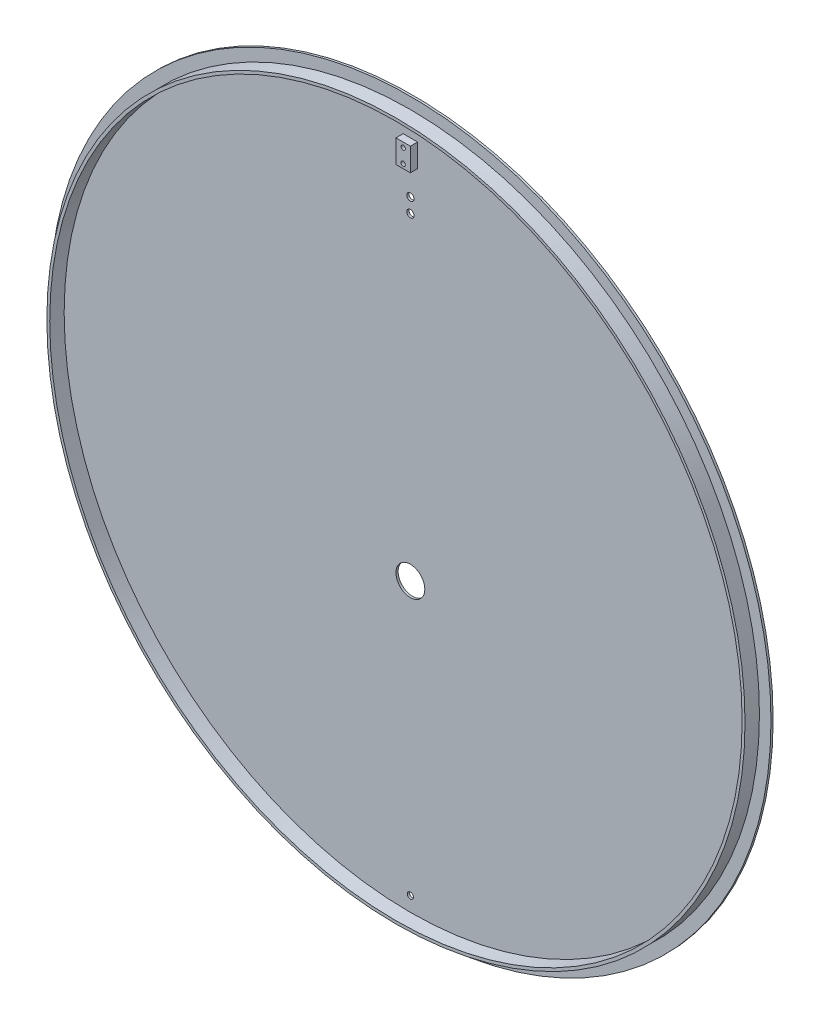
ISO-10303-21;
HEADER;
FILE_DESCRIPTION(('STEP AP214'),'2;1');
FILE_NAME('part.step','',(''),(''),'','','');
FILE_SCHEMA(('AUTOMOTIVE_DESIGN { 1 0 10303 214 1 1 1 1 }'));
ENDSEC;
DATA;
#1=APPLICATION_CONTEXT('core data for automotive mechanical design processes');
#2=APPLICATION_PROTOCOL_DEFINITION('international standard','automotive_design',2000,#1);
#3=PRODUCT_CONTEXT('',#1,'mechanical');
#4=PRODUCT('Part','Part','',(#3));
#5=PRODUCT_RELATED_PRODUCT_CATEGORY('part','',(#4));
#6=PRODUCT_DEFINITION_FORMATION('','',#4);
#7=PRODUCT_DEFINITION_CONTEXT('part definition',#1,'design');
#8=PRODUCT_DEFINITION('design','',#6,#7);
#9=PRODUCT_DEFINITION_SHAPE('','',#8);
#10=(LENGTH_UNIT() NAMED_UNIT(*) SI_UNIT(.MILLI.,.METRE.));
#11=(NAMED_UNIT(*) PLANE_ANGLE_UNIT() SI_UNIT($,.RADIAN.));
#12=(NAMED_UNIT(*) SI_UNIT($,.STERADIAN.) SOLID_ANGLE_UNIT());
#13=UNCERTAINTY_MEASURE_WITH_UNIT(LENGTH_MEASURE(1.E-05),#10,'distance_accuracy_value','');
#14=(GEOMETRIC_REPRESENTATION_CONTEXT(3) GLOBAL_UNCERTAINTY_ASSIGNED_CONTEXT((#13)) GLOBAL_UNIT_ASSIGNED_CONTEXT((#10,
#11,#12)) REPRESENTATION_CONTEXT('',''));
#15=CARTESIAN_POINT('',(0.,0.,0.));
#16=DIRECTION('',(0.,0.,1.));
#17=DIRECTION('',(1.,0.,0.));
#18=AXIS2_PLACEMENT_3D('',#15,#16,#17);
#19=CARTESIAN_POINT('',(0.,0.,3.));
#20=DIRECTION('',(0.,0.,1.));
#21=DIRECTION('',(1.,0.,0.));
#22=AXIS2_PLACEMENT_3D('',#19,#20,#21);
#23=PLANE('',#22);
#24=CARTESIAN_POINT('',(0.,0.,3.));
#25=DIRECTION('',(0.,0.,1.));
#26=DIRECTION('',(1.,0.,0.));
#27=AXIS2_PLACEMENT_3D('',#24,#25,#26);
#28=CIRCLE('',#27,500.);
#29=CARTESIAN_POINT('',(500.,0.,3.));
#30=VERTEX_POINT('',#29);
#31=EDGE_CURVE('E148',#30,#30,#28,.T.);
#32=ORIENTED_EDGE('',*,*,#31,.T.);
#33=EDGE_LOOP('',(#32));
#34=FACE_BOUND('',#33,.T.);
#35=CARTESIAN_POINT('',(0.,0.,3.));
#36=DIRECTION('',(0.,0.,1.));
#37=DIRECTION('',(1.,0.,0.));
#38=AXIS2_PLACEMENT_3D('',#35,#36,#37);
#39=CIRCLE('',#38,484.);
#40=CARTESIAN_POINT('',(484.,0.,3.));
#41=VERTEX_POINT('',#40);
#42=EDGE_CURVE('E139',#41,#41,#39,.T.);
#43=ORIENTED_EDGE('',*,*,#42,.F.);
#44=EDGE_LOOP('',(#43));
#45=FACE_BOUND('',#44,.T.);
#46=ADVANCED_FACE('F31',(#34,#45),#23,.T.);
#47=CARTESIAN_POINT('',(0.,0.,3.));
#48=DIRECTION('',(0.,0.,-1.));
#49=DIRECTION('',(-1.,0.,0.));
#50=AXIS2_PLACEMENT_3D('',#47,#48,#49);
#51=CYLINDRICAL_SURFACE('',#50,500.);
#52=ORIENTED_EDGE('',*,*,#31,.F.);
#53=EDGE_LOOP('',(#52));
#54=FACE_BOUND('',#53,.T.);
#55=CARTESIAN_POINT('',(0.,0.,0.));
#56=DIRECTION('',(0.,0.,1.));
#57=DIRECTION('',(1.,0.,0.));
#58=AXIS2_PLACEMENT_3D('',#55,#56,#57);
#59=CIRCLE('',#58,500.);
#60=CARTESIAN_POINT('',(500.,0.,0.));
#61=VERTEX_POINT('',#60);
#62=EDGE_CURVE('E145',#61,#61,#59,.T.);
#63=ORIENTED_EDGE('',*,*,#62,.T.);
#64=EDGE_LOOP('',(#63));
#65=FACE_BOUND('',#64,.T.);
#66=ADVANCED_FACE('F33',(#54,#65),#51,.T.);
#67=CARTESIAN_POINT('',(0.,0.,0.));
#68=DIRECTION('',(0.,0.,1.));
#69=DIRECTION('',(1.,0.,0.));
#70=AXIS2_PLACEMENT_3D('',#67,#68,#69);
#71=PLANE('',#70);
#72=CARTESIAN_POINT('',(0.,379.,0.));
#73=DIRECTION('',(0.,0.,1.));
#74=DIRECTION('',(1.,0.,0.));
#75=AXIS2_PLACEMENT_3D('',#72,#73,#74);
#76=CIRCLE('',#75,5.);
#77=CARTESIAN_POINT('',(5.,379.,0.));
#78=VERTEX_POINT('',#77);
#79=EDGE_CURVE('E112',#78,#78,#76,.T.);
#80=ORIENTED_EDGE('',*,*,#79,.T.);
#81=EDGE_LOOP('',(#80));
#82=FACE_BOUND('',#81,.T.);
#83=CARTESIAN_POINT('',(0.,359.,0.));
#84=DIRECTION('',(0.,0.,1.));
#85=DIRECTION('',(1.,0.,0.));
#86=AXIS2_PLACEMENT_3D('',#83,#84,#85);
#87=CIRCLE('',#86,5.);
#88=CARTESIAN_POINT('',(5.,359.,0.));
#89=VERTEX_POINT('',#88);
#90=EDGE_CURVE('E118',#89,#89,#87,.T.);
#91=ORIENTED_EDGE('',*,*,#90,.T.);
#92=EDGE_LOOP('',(#91));
#93=FACE_BOUND('',#92,.T.);
#94=CARTESIAN_POINT('',(0.,-459.81,0.));
#95=DIRECTION('',(0.,0.,1.));
#96=DIRECTION('',(1.,0.,0.));
#97=AXIS2_PLACEMENT_3D('',#94,#95,#96);
#98=CIRCLE('',#97,4.25);
#99=CARTESIAN_POINT('',(4.25,-459.81,0.));
#100=VERTEX_POINT('',#99);
#101=EDGE_CURVE('E126',#100,#100,#98,.T.);
#102=ORIENTED_EDGE('',*,*,#101,.T.);
#103=EDGE_LOOP('',(#102));
#104=FACE_BOUND('',#103,.T.);
#105=CARTESIAN_POINT('',(0.,-82.,0.));
#106=DIRECTION('',(0.,0.,1.));
#107=DIRECTION('',(1.,0.,0.));
#108=AXIS2_PLACEMENT_3D('',#105,#106,#107);
#109=CIRCLE('',#108,20.);
#110=CARTESIAN_POINT('',(20.,-82.,0.));
#111=VERTEX_POINT('',#110);
#112=EDGE_CURVE('E130',#111,#111,#109,.T.);
#113=ORIENTED_EDGE('',*,*,#112,.T.);
#114=EDGE_LOOP('',(#113));
#115=FACE_BOUND('',#114,.T.);
#116=ORIENTED_EDGE('',*,*,#62,.F.);
#117=EDGE_LOOP('',(#116));
#118=FACE_BOUND('',#117,.T.);
#119=ADVANCED_FACE('F176',(#82,#93,#104,#115,#118),#71,.F.);
#120=CARTESIAN_POINT('',(0.,0.,23.));
#121=DIRECTION('',(0.,0.,1.));
#122=DIRECTION('',(1.,0.,0.));
#123=AXIS2_PLACEMENT_3D('',#120,#121,#122);
#124=PLANE('',#123);
#125=CARTESIAN_POINT('',(0.,0.,23.));
#126=DIRECTION('',(0.,0.,1.));
#127=DIRECTION('',(1.,0.,0.));
#128=AXIS2_PLACEMENT_3D('',#125,#126,#127);
#129=CIRCLE('',#128,480.);
#130=CARTESIAN_POINT('',(480.,0.,23.));
#131=VERTEX_POINT('',#130);
#132=EDGE_CURVE('E133',#131,#131,#129,.T.);
#133=ORIENTED_EDGE('',*,*,#132,.F.);
#134=EDGE_LOOP('',(#133));
#135=FACE_BOUND('',#134,.T.);
#136=CARTESIAN_POINT('',(0.,0.,23.));
#137=DIRECTION('',(0.,0.,1.));
#138=DIRECTION('',(1.,0.,0.));
#139=AXIS2_PLACEMENT_3D('',#136,#137,#138);
#140=CIRCLE('',#139,484.);
#141=CARTESIAN_POINT('',(484.,0.,23.));
#142=VERTEX_POINT('',#141);
#143=EDGE_CURVE('E142',#142,#142,#140,.T.);
#144=ORIENTED_EDGE('',*,*,#143,.T.);
#145=EDGE_LOOP('',(#144));
#146=FACE_BOUND('',#145,.T.);
#147=ADVANCED_FACE('F205',(#135,#146),#124,.T.);
#148=CARTESIAN_POINT('',(0.,0.,23.));
#149=DIRECTION('',(0.,0.,-1.));
#150=DIRECTION('',(-1.,0.,0.));
#151=AXIS2_PLACEMENT_3D('',#148,#149,#150);
#152=CYLINDRICAL_SURFACE('',#151,484.);
#153=ORIENTED_EDGE('',*,*,#143,.F.);
#154=EDGE_LOOP('',(#153));
#155=FACE_BOUND('',#154,.T.);
#156=ORIENTED_EDGE('',*,*,#42,.T.);
#157=EDGE_LOOP('',(#156));
#158=FACE_BOUND('',#157,.T.);
#159=ADVANCED_FACE('F189',(#155,#158),#152,.T.);
#160=CARTESIAN_POINT('',(0.,0.,3.));
#161=DIRECTION('',(0.,0.,1.));
#162=DIRECTION('',(1.,0.,0.));
#163=AXIS2_PLACEMENT_3D('',#160,#161,#162);
#164=CYLINDRICAL_SURFACE('',#163,480.);
#165=CARTESIAN_POINT('',(0.,0.,3.));
#166=DIRECTION('',(0.,0.,1.));
#167=DIRECTION('',(1.,0.,0.));
#168=AXIS2_PLACEMENT_3D('',#165,#166,#167);
#169=CIRCLE('',#168,480.);
#170=CARTESIAN_POINT('',(480.,0.,3.));
#171=VERTEX_POINT('',#170);
#172=EDGE_CURVE('E136',#171,#171,#169,.T.);
#173=ORIENTED_EDGE('',*,*,#172,.F.);
#174=EDGE_LOOP('',(#173));
#175=FACE_BOUND('',#174,.T.);
#176=ORIENTED_EDGE('',*,*,#132,.T.);
#177=EDGE_LOOP('',(#176));
#178=FACE_BOUND('',#177,.T.);
#179=ADVANCED_FACE('F181',(#175,#178),#164,.F.);
#180=DIRECTION('',(0.,-1.,0.));
#181=VECTOR('',#180,1.);
#182=CARTESIAN_POINT('',(10.,-1056.14142135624,3.));
#183=LINE('',#182,#181);
#184=CARTESIAN_POINT('',(10.,450.,3.));
#185=VERTEX_POINT('',#184);
#186=CARTESIAN_POINT('',(10.,418.,3.));
#187=VERTEX_POINT('',#186);
#188=EDGE_CURVE('E77',#185,#187,#183,.T.);
#189=ORIENTED_EDGE('',*,*,#188,.T.);
#190=DIRECTION('',(-1.,0.,0.));
#191=VECTOR('',#190,1.);
#192=CARTESIAN_POINT('',(0.,418.,3.));
#193=LINE('',#192,#191);
#194=CARTESIAN_POINT('',(-10.,418.,3.));
#195=VERTEX_POINT('',#194);
#196=EDGE_CURVE('E104',#187,#195,#193,.T.);
#197=ORIENTED_EDGE('',*,*,#196,.T.);
#198=DIRECTION('',(0.,1.,0.));
#199=VECTOR('',#198,1.);
#200=CARTESIAN_POINT('',(-10.,-1056.14142135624,3.));
#201=LINE('',#200,#199);
#202=CARTESIAN_POINT('',(-10.,450.,3.));
#203=VERTEX_POINT('',#202);
#204=EDGE_CURVE('E51',#195,#203,#201,.T.);
#205=ORIENTED_EDGE('',*,*,#204,.T.);
#206=DIRECTION('',(1.,0.,0.));
#207=VECTOR('',#206,1.);
#208=CARTESIAN_POINT('',(0.,450.,3.));
#209=LINE('',#208,#207);
#210=EDGE_CURVE('E46',#203,#185,#209,.T.);
#211=ORIENTED_EDGE('',*,*,#210,.T.);
#212=EDGE_LOOP('',(#189,#197,#205,#211));
#213=FACE_BOUND('',#212,.T.);
#214=CARTESIAN_POINT('',(0.,379.,3.));
#215=DIRECTION('',(0.,0.,1.));
#216=DIRECTION('',(1.,0.,0.));
#217=AXIS2_PLACEMENT_3D('',#214,#215,#216);
#218=CIRCLE('',#217,5.);
#219=CARTESIAN_POINT('',(5.,379.,3.));
#220=VERTEX_POINT('',#219);
#221=EDGE_CURVE('E80',#220,#220,#218,.T.);
#222=ORIENTED_EDGE('',*,*,#221,.F.);
#223=EDGE_LOOP('',(#222));
#224=FACE_BOUND('',#223,.T.);
#225=CARTESIAN_POINT('',(0.,359.,3.));
#226=DIRECTION('',(0.,0.,1.));
#227=DIRECTION('',(1.,0.,0.));
#228=AXIS2_PLACEMENT_3D('',#225,#226,#227);
#229=CIRCLE('',#228,5.);
#230=CARTESIAN_POINT('',(5.,359.,3.));
#231=VERTEX_POINT('',#230);
#232=EDGE_CURVE('E115',#231,#231,#229,.T.);
#233=ORIENTED_EDGE('',*,*,#232,.F.);
#234=EDGE_LOOP('',(#233));
#235=FACE_BOUND('',#234,.T.);
#236=CARTESIAN_POINT('',(0.,-459.81,3.));
#237=DIRECTION('',(0.,0.,1.));
#238=DIRECTION('',(1.,0.,0.));
#239=AXIS2_PLACEMENT_3D('',#236,#237,#238);
#240=CIRCLE('',#239,4.25);
#241=CARTESIAN_POINT('',(4.25,-459.81,3.));
#242=VERTEX_POINT('',#241);
#243=EDGE_CURVE('E121',#242,#242,#240,.T.);
#244=ORIENTED_EDGE('',*,*,#243,.F.);
#245=EDGE_LOOP('',(#244));
#246=FACE_BOUND('',#245,.T.);
#247=CARTESIAN_POINT('',(0.,-82.,3.));
#248=DIRECTION('',(0.,0.,1.));
#249=DIRECTION('',(1.,0.,0.));
#250=AXIS2_PLACEMENT_3D('',#247,#248,#249);
#251=CIRCLE('',#250,20.);
#252=CARTESIAN_POINT('',(20.,-82.,3.));
#253=VERTEX_POINT('',#252);
#254=EDGE_CURVE('E129',#253,#253,#251,.T.);
#255=ORIENTED_EDGE('',*,*,#254,.F.);
#256=EDGE_LOOP('',(#255));
#257=FACE_BOUND('',#256,.T.);
#258=ORIENTED_EDGE('',*,*,#172,.T.);
#259=EDGE_LOOP('',(#258));
#260=FACE_BOUND('',#259,.T.);
#261=ADVANCED_FACE('F166',(#213,#224,#235,#246,#257,#260),#23,.T.);
#262=CARTESIAN_POINT('',(0.,-82.,0.));
#263=DIRECTION('',(0.,0.,1.));
#264=DIRECTION('',(1.,0.,0.));
#265=AXIS2_PLACEMENT_3D('',#262,#263,#264);
#266=CYLINDRICAL_SURFACE('',#265,20.);
#267=ORIENTED_EDGE('',*,*,#112,.F.);
#268=EDGE_LOOP('',(#267));
#269=FACE_BOUND('',#268,.T.);
#270=ORIENTED_EDGE('',*,*,#254,.T.);
#271=EDGE_LOOP('',(#270));
#272=FACE_BOUND('',#271,.T.);
#273=ADVANCED_FACE('F180',(#269,#272),#266,.F.);
#274=CARTESIAN_POINT('',(0.,-459.81,3.));
#275=DIRECTION('',(0.,0.,1.));
#276=DIRECTION('',(1.,0.,0.));
#277=AXIS2_PLACEMENT_3D('',#274,#275,#276);
#278=CYLINDRICAL_SURFACE('',#277,4.25);
#279=ORIENTED_EDGE('',*,*,#243,.T.);
#280=EDGE_LOOP('',(#279));
#281=FACE_BOUND('',#280,.T.);
#282=ORIENTED_EDGE('',*,*,#101,.F.);
#283=EDGE_LOOP('',(#282));
#284=FACE_BOUND('',#283,.T.);
#285=ADVANCED_FACE('F186',(#281,#284),#278,.F.);
#286=CARTESIAN_POINT('',(0.,359.,0.));
#287=DIRECTION('',(0.,0.,1.));
#288=DIRECTION('',(1.,0.,0.));
#289=AXIS2_PLACEMENT_3D('',#286,#287,#288);
#290=CYLINDRICAL_SURFACE('',#289,5.);
#291=ORIENTED_EDGE('',*,*,#90,.F.);
#292=EDGE_LOOP('',(#291));
#293=FACE_BOUND('',#292,.T.);
#294=ORIENTED_EDGE('',*,*,#232,.T.);
#295=EDGE_LOOP('',(#294));
#296=FACE_BOUND('',#295,.T.);
#297=ADVANCED_FACE('F219',(#293,#296),#290,.F.);
#298=CARTESIAN_POINT('',(0.,379.,0.));
#299=DIRECTION('',(0.,0.,1.));
#300=DIRECTION('',(1.,0.,0.));
#301=AXIS2_PLACEMENT_3D('',#298,#299,#300);
#302=CYLINDRICAL_SURFACE('',#301,5.);
#303=ORIENTED_EDGE('',*,*,#79,.F.);
#304=EDGE_LOOP('',(#303));
#305=FACE_BOUND('',#304,.T.);
#306=ORIENTED_EDGE('',*,*,#221,.T.);
#307=EDGE_LOOP('',(#306));
#308=FACE_BOUND('',#307,.T.);
#309=ADVANCED_FACE('F223',(#305,#308),#302,.F.);
#310=CARTESIAN_POINT('',(10.,-1056.14142135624,13.));
#311=DIRECTION('',(1.,0.,0.));
#312=DIRECTION('',(0.,0.,-1.));
#313=AXIS2_PLACEMENT_3D('',#310,#311,#312);
#314=PLANE('',#313);
#315=ORIENTED_EDGE('',*,*,#188,.F.);
#316=DIRECTION('',(0.,0.,-1.));
#317=VECTOR('',#316,1.);
#318=CARTESIAN_POINT('',(10.,450.,13.));
#319=LINE('',#318,#317);
#320=CARTESIAN_POINT('',(10.,450.,13.));
#321=VERTEX_POINT('',#320);
#322=EDGE_CURVE('E71',#321,#185,#319,.T.);
#323=ORIENTED_EDGE('',*,*,#322,.F.);
#324=DIRECTION('',(0.,-1.,0.));
#325=VECTOR('',#324,1.);
#326=CARTESIAN_POINT('',(10.,-1056.14142135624,13.));
#327=LINE('',#326,#325);
#328=CARTESIAN_POINT('',(10.,418.,13.));
#329=VERTEX_POINT('',#328);
#330=EDGE_CURVE('E75',#321,#329,#327,.T.);
#331=ORIENTED_EDGE('',*,*,#330,.T.);
#332=DIRECTION('',(0.,0.,-1.));
#333=VECTOR('',#332,1.);
#334=CARTESIAN_POINT('',(10.,418.,13.));
#335=LINE('',#334,#333);
#336=EDGE_CURVE('E100',#329,#187,#335,.T.);
#337=ORIENTED_EDGE('',*,*,#336,.T.);
#338=EDGE_LOOP('',(#315,#323,#331,#337));
#339=FACE_BOUND('',#338,.T.);
#340=ADVANCED_FACE('F73',(#339),#314,.T.);
#341=CARTESIAN_POINT('',(0.,450.,13.));
#342=DIRECTION('',(0.,1.,0.));
#343=DIRECTION('',(0.,0.,1.));
#344=AXIS2_PLACEMENT_3D('',#341,#342,#343);
#345=PLANE('',#344);
#346=ORIENTED_EDGE('',*,*,#210,.F.);
#347=DIRECTION('',(0.,0.,-1.));
#348=VECTOR('',#347,1.);
#349=CARTESIAN_POINT('',(-10.,450.,13.));
#350=LINE('',#349,#348);
#351=CARTESIAN_POINT('',(-10.,450.,13.));
#352=VERTEX_POINT('',#351);
#353=EDGE_CURVE('E81',#352,#203,#350,.T.);
#354=ORIENTED_EDGE('',*,*,#353,.F.);
#355=DIRECTION('',(1.,0.,0.));
#356=VECTOR('',#355,1.);
#357=CARTESIAN_POINT('',(0.,450.,13.));
#358=LINE('',#357,#356);
#359=EDGE_CURVE('E87',#352,#321,#358,.T.);
#360=ORIENTED_EDGE('',*,*,#359,.T.);
#361=ORIENTED_EDGE('',*,*,#322,.T.);
#362=EDGE_LOOP('',(#346,#354,#360,#361));
#363=FACE_BOUND('',#362,.T.);
#364=ADVANCED_FACE('F93',(#363),#345,.T.);
#365=CARTESIAN_POINT('',(-10.,-1056.14142135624,13.));
#366=DIRECTION('',(-1.,0.,0.));
#367=DIRECTION('',(0.,0.,1.));
#368=AXIS2_PLACEMENT_3D('',#365,#366,#367);
#369=PLANE('',#368);
#370=ORIENTED_EDGE('',*,*,#204,.F.);
#371=DIRECTION('',(0.,0.,-1.));
#372=VECTOR('',#371,1.);
#373=CARTESIAN_POINT('',(-10.,418.,13.));
#374=LINE('',#373,#372);
#375=CARTESIAN_POINT('',(-10.,418.,13.));
#376=VERTEX_POINT('',#375);
#377=EDGE_CURVE('E108',#376,#195,#374,.T.);
#378=ORIENTED_EDGE('',*,*,#377,.F.);
#379=DIRECTION('',(0.,1.,0.));
#380=VECTOR('',#379,1.);
#381=CARTESIAN_POINT('',(-10.,-1056.14142135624,13.));
#382=LINE('',#381,#380);
#383=EDGE_CURVE('E94',#376,#352,#382,.T.);
#384=ORIENTED_EDGE('',*,*,#383,.T.);
#385=ORIENTED_EDGE('',*,*,#353,.T.);
#386=EDGE_LOOP('',(#370,#378,#384,#385));
#387=FACE_BOUND('',#386,.T.);
#388=ADVANCED_FACE('F234',(#387),#369,.T.);
#389=CARTESIAN_POINT('',(0.,424.,13.));
#390=DIRECTION('',(0.,0.,-1.));
#391=DIRECTION('',(-1.,0.,0.));
#392=AXIS2_PLACEMENT_3D('',#389,#390,#391);
#393=CYLINDRICAL_SURFACE('',#392,3.);
#394=CARTESIAN_POINT('',(0.,424.,13.));
#395=DIRECTION('',(0.,0.,1.));
#396=DIRECTION('',(1.,0.,0.));
#397=AXIS2_PLACEMENT_3D('',#394,#395,#396);
#398=CIRCLE('',#397,3.);
#399=CARTESIAN_POINT('',(3.,424.,13.));
#400=VERTEX_POINT('',#399);
#401=EDGE_CURVE('E91',#400,#400,#398,.T.);
#402=ORIENTED_EDGE('',*,*,#401,.T.);
#403=EDGE_LOOP('',(#402));
#404=FACE_BOUND('',#403,.T.);
#405=CARTESIAN_POINT('',(0.,424.,3.));
#406=DIRECTION('',(0.,0.,1.));
#407=DIRECTION('',(1.,0.,0.));
#408=AXIS2_PLACEMENT_3D('',#405,#406,#407);
#409=CIRCLE('',#408,3.);
#410=CARTESIAN_POINT('',(3.,424.,3.));
#411=VERTEX_POINT('',#410);
#412=EDGE_CURVE('E11',#411,#411,#409,.F.);
#413=ORIENTED_EDGE('',*,*,#412,.T.);
#414=EDGE_LOOP('',(#413));
#415=FACE_BOUND('',#414,.T.);
#416=ADVANCED_FACE('F230',(#404,#415),#393,.F.);
#417=CARTESIAN_POINT('',(0.,443.27,13.));
#418=DIRECTION('',(0.,0.,-1.));
#419=DIRECTION('',(-1.,0.,0.));
#420=AXIS2_PLACEMENT_3D('',#417,#418,#419);
#421=CYLINDRICAL_SURFACE('',#420,3.);
#422=CARTESIAN_POINT('',(0.,443.27,13.));
#423=DIRECTION('',(0.,0.,1.));
#424=DIRECTION('',(1.,0.,0.));
#425=AXIS2_PLACEMENT_3D('',#422,#423,#424);
#426=CIRCLE('',#425,3.);
#427=CARTESIAN_POINT('',(3.,443.27,13.));
#428=VERTEX_POINT('',#427);
#429=EDGE_CURVE('E106',#428,#428,#426,.T.);
#430=ORIENTED_EDGE('',*,*,#429,.T.);
#431=EDGE_LOOP('',(#430));
#432=FACE_BOUND('',#431,.T.);
#433=CARTESIAN_POINT('',(0.,443.27,3.));
#434=DIRECTION('',(0.,0.,1.));
#435=DIRECTION('',(1.,0.,0.));
#436=AXIS2_PLACEMENT_3D('',#433,#434,#435);
#437=CIRCLE('',#436,3.);
#438=CARTESIAN_POINT('',(3.,443.27,3.));
#439=VERTEX_POINT('',#438);
#440=EDGE_CURVE('E39',#439,#439,#437,.F.);
#441=ORIENTED_EDGE('',*,*,#440,.T.);
#442=EDGE_LOOP('',(#441));
#443=FACE_BOUND('',#442,.T.);
#444=ADVANCED_FACE('F155',(#432,#443),#421,.F.);
#445=CARTESIAN_POINT('',(0.,418.,13.));
#446=DIRECTION('',(0.,-1.,0.));
#447=DIRECTION('',(0.,0.,-1.));
#448=AXIS2_PLACEMENT_3D('',#445,#446,#447);
#449=PLANE('',#448);
#450=ORIENTED_EDGE('',*,*,#196,.F.);
#451=ORIENTED_EDGE('',*,*,#336,.F.);
#452=DIRECTION('',(-1.,0.,0.));
#453=VECTOR('',#452,1.);
#454=CARTESIAN_POINT('',(0.,418.,13.));
#455=LINE('',#454,#453);
#456=EDGE_CURVE('E90',#329,#376,#455,.T.);
#457=ORIENTED_EDGE('',*,*,#456,.T.);
#458=ORIENTED_EDGE('',*,*,#377,.T.);
#459=EDGE_LOOP('',(#450,#451,#457,#458));
#460=FACE_BOUND('',#459,.T.);
#461=ADVANCED_FACE('F167',(#460),#449,.T.);
#462=CARTESIAN_POINT('',(0.,-1056.14142135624,13.));
#463=DIRECTION('',(0.,0.,1.));
#464=DIRECTION('',(1.,0.,0.));
#465=AXIS2_PLACEMENT_3D('',#462,#463,#464);
#466=PLANE('',#465);
#467=ORIENTED_EDGE('',*,*,#429,.F.);
#468=EDGE_LOOP('',(#467));
#469=FACE_BOUND('',#468,.T.);
#470=ORIENTED_EDGE('',*,*,#401,.F.);
#471=EDGE_LOOP('',(#470));
#472=FACE_BOUND('',#471,.T.);
#473=ORIENTED_EDGE('',*,*,#330,.F.);
#474=ORIENTED_EDGE('',*,*,#359,.F.);
#475=ORIENTED_EDGE('',*,*,#383,.F.);
#476=ORIENTED_EDGE('',*,*,#456,.F.);
#477=EDGE_LOOP('',(#473,#474,#475,#476));
#478=FACE_BOUND('',#477,.T.);
#479=ADVANCED_FACE('F85',(#469,#472,#478),#466,.T.);
#480=ORIENTED_EDGE('',*,*,#440,.F.);
#481=EDGE_LOOP('',(#480));
#482=FACE_BOUND('',#481,.T.);
#483=ADVANCED_FACE('F157',(#482),#23,.T.);
#484=ORIENTED_EDGE('',*,*,#412,.F.);
#485=EDGE_LOOP('',(#484));
#486=FACE_BOUND('',#485,.T.);
#487=ADVANCED_FACE('F159',(#486),#23,.T.);
#488=CLOSED_SHELL('',(#46,#66,#119,#147,#159,#179,#261,#273,#285,#297,#309,#340,#364,#388,#416,
#444,#461,#479,#483,#487));
#489=MANIFOLD_SOLID_BREP('B2',#488);
#490=ADVANCED_BREP_SHAPE_REPRESENTATION('',(#18,#489),#14);
#491=SHAPE_DEFINITION_REPRESENTATION(#9,#490);
ENDSEC;
END-ISO-10303-21;
